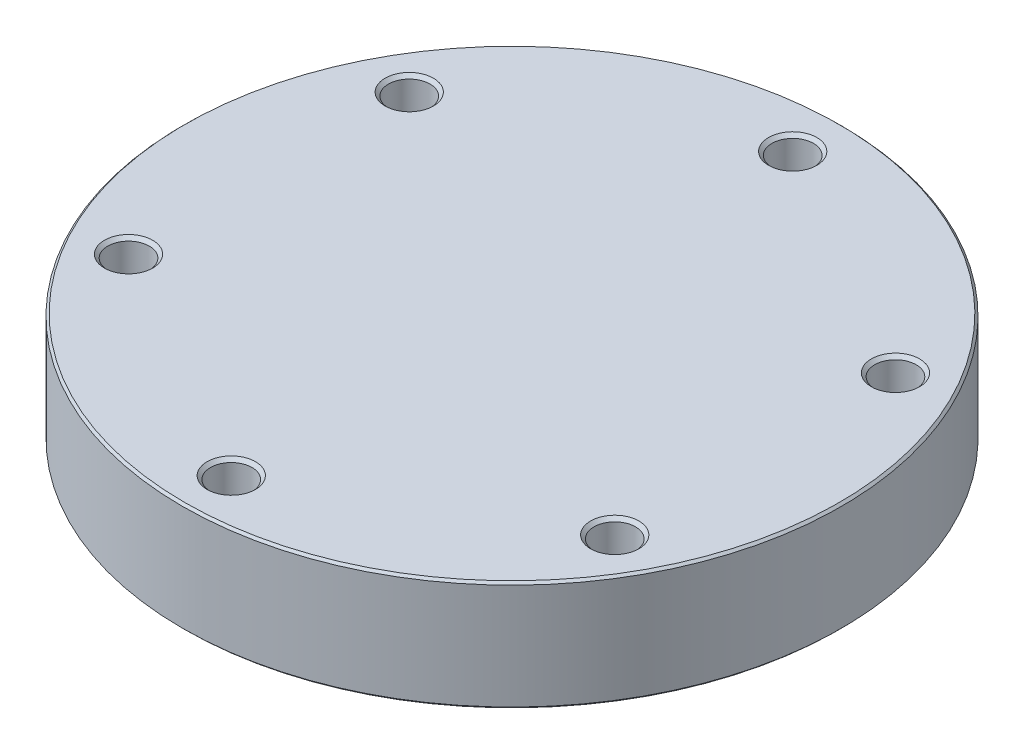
from build123d import *

# Parameters (mm, degrees)
SKETCH1_R                            = 37.2745
BOSS_EXTRUDE1_DEPTH                  = 12.446
F_13_0_185_DIAMETER_HOLE1_AT_2_COUNT = 2
F_13_0_185_DIAMETER_HOLE1_AT_2_PITCH = 31.75
F_13_0_185_DIAMETER_HOLE1_AT_3_COUNT = 2
F_13_0_185_DIAMETER_HOLE1_AT_3_PITCH = 54.99261314
F_13_0_185_DIAMETER_HOLE1_AT_4_COUNT = 2
F_13_0_185_DIAMETER_HOLE1_AT_4_PITCH = 63.5
F_13_0_185_DIAMETER_HOLE1_AT_5_COUNT = 2
F_13_0_185_DIAMETER_HOLE1_AT_5_PITCH = 54.99261314
F_13_0_185_DIAMETER_HOLE1_AT_6_COUNT = 2
F_13_0_185_DIAMETER_HOLE1_AT_6_PITCH = 31.75
CHAMFER1_SIZE                        = 0.254
SKETCH4_R                            = 27.6987
SKETCH4_R_2                          = 23.6093
CUT_EXTRUDE1_DEPTH                   = 2.6416
FILLET1_R                            = 0.381
CHAMFER2_SIZE                        = 0.127


with BuildPart() as part:
    # Sketch1 → Boss-Extrude1 (new body)
    with BuildSketch(Plane(origin=(0, 0, 0), x_dir=(1, 0, 0), z_dir=(0, 1, 0))):
        with Locations(Location((0, 0, 0), (0, 0, 270))):
            Circle(SKETCH1_R)
    extrude(amount=BOSS_EXTRUDE1_DEPTH)

    # Sketch3 → 13 _0.185_ Diameter Hole1 (revolve, cut)
    with BuildSketch(Plane(origin=(0, 12.446, -31.75), x_dir=(0, 0, 1), z_dir=(1, 0, 0))):
        Polygon((0, 0), (0, 12.446), (2.7305, 12.446), (2.3495, 12.065), (2.3495, 0.381), (2.7305, 0), align=None)
    f_13_0_185_diameter_hole1 = revolve(axis=Axis((0, 18.796, -31.75), (0, -1, 0)), mode=Mode.SUBTRACT)

    # 13 _0.185_ Diameter Hole1 at 2: 13 _0.185_ Diameter Hole1 ×2
    with Locations(*[Vector(0.8660254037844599, 0, 0.4999999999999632) * (i * F_13_0_185_DIAMETER_HOLE1_AT_2_PITCH) for i in range(1, F_13_0_185_DIAMETER_HOLE1_AT_2_COUNT)]):
        add(f_13_0_185_diameter_hole1, mode=Mode.SUBTRACT)

    # 13 _0.185_ Diameter Hole1 at 3: 13 _0.185_ Diameter Hole1 ×2
    with Locations(*[Vector(0.5000000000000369, 0, 0.8660254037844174) * (i * F_13_0_185_DIAMETER_HOLE1_AT_3_PITCH) for i in range(1, F_13_0_185_DIAMETER_HOLE1_AT_3_COUNT)]):
        add(f_13_0_185_diameter_hole1, mode=Mode.SUBTRACT)

    # 13 _0.185_ Diameter Hole1 at 4: 13 _0.185_ Diameter Hole1 ×2
    with Locations(*[(0, 0, i * F_13_0_185_DIAMETER_HOLE1_AT_4_PITCH) for i in range(1, F_13_0_185_DIAMETER_HOLE1_AT_4_COUNT)]):
        add(f_13_0_185_diameter_hole1, mode=Mode.SUBTRACT)

    # 13 _0.185_ Diameter Hole1 at 5: 13 _0.185_ Diameter Hole1 ×2
    with Locations(*[Vector(-0.4999999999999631, 0, 0.86602540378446) * (i * F_13_0_185_DIAMETER_HOLE1_AT_5_PITCH) for i in range(1, F_13_0_185_DIAMETER_HOLE1_AT_5_COUNT)]):
        add(f_13_0_185_diameter_hole1, mode=Mode.SUBTRACT)

    # 13 _0.185_ Diameter Hole1 at 6: 13 _0.185_ Diameter Hole1 ×2
    with Locations(*[Vector(-0.8660254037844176, 0, 0.5000000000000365) * (i * F_13_0_185_DIAMETER_HOLE1_AT_6_PITCH) for i in range(1, F_13_0_185_DIAMETER_HOLE1_AT_6_COUNT)]):
        add(f_13_0_185_diameter_hole1, mode=Mode.SUBTRACT)

    # Chamfer1
    chamfer1_edges = [part.edges().sort_by_distance(p)[0] for p in [
        (0, 0, -37.2745),
        (0, 12.446, -37.2745),
    ]]
    chamfer(chamfer1_edges, length=CHAMFER1_SIZE)

    # Sketch4 → Cut-Extrude1 (cut)
    with BuildSketch(Plane.XZ):
        with Locations(Location((0, 0, 0), (0, 0, 270))):
            Circle(SKETCH4_R)
        with Locations(Location((0, 0, 0), (0, 0, 270))):
            Circle(SKETCH4_R_2, mode=Mode.SUBTRACT)
    extrude(amount=-CUT_EXTRUDE1_DEPTH, mode=Mode.SUBTRACT)

    # Fillet1
    fillet1_edges = [part.edges().sort_by_distance(p)[0] for p in [
        (0, 2.6416, 27.6987),
        (0, 2.6416, 23.6093),
    ]]
    fillet(fillet1_edges, radius=FILLET1_R)

    # Chamfer2
    chamfer2_edges = [part.edges().sort_by_distance(p)[0] for p in [
        (0, 0, 27.6987),
        (0, 0, 23.6093),
    ]]
    chamfer(chamfer2_edges, length=CHAMFER2_SIZE)


solid = part.part
